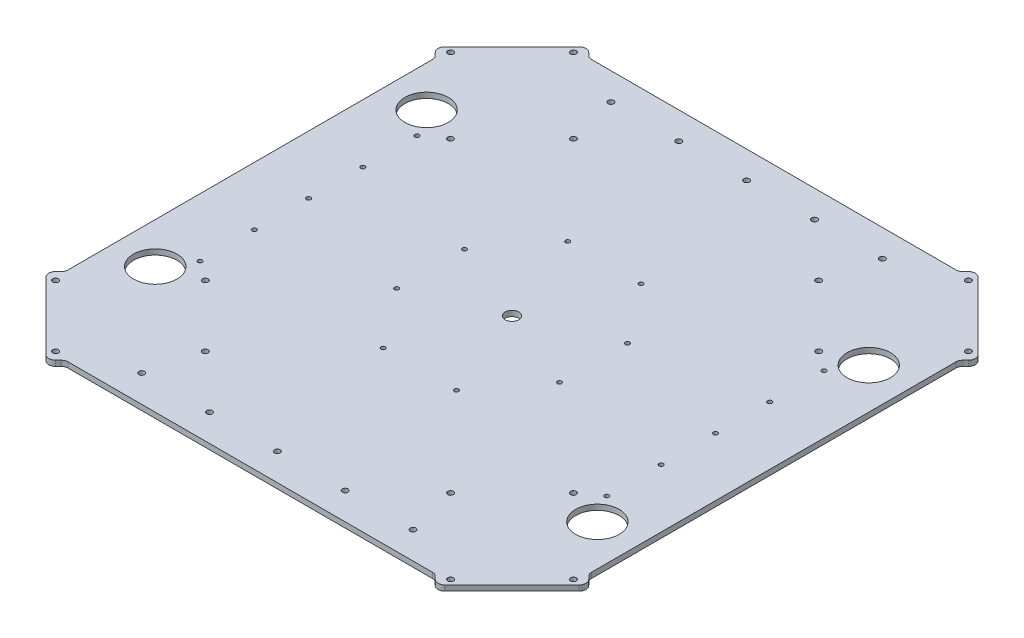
from build123d import *

# Parameters (mm, degrees)
EXTRUDE_1_DEPTH     = 4
SKETCH_2_R          = 2.1
CUT_EXTRUDE_1_DEPTH = 283.870995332
CUT_EXTRUDE_2_DEPTH = 283.870995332
SKETCH_4_R          = 5
CUT_EXTRUDE_3_DEPTH = 283.870995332
SKETCH_5_R          = 16
CUT_EXTRUDE_4_DEPTH = 283.870995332
SKETCH_6_R          = 1.6
CUT_EXTRUDE_5_DEPTH = 283.870995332
SKETCH_7_R          = 2.1
CUT_EXTRUDE_6_DEPTH = 283.870995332
SKETCH_8_R          = 1.6
CUT_EXTRUDE_7_DEPTH = 10
FILLET_1_R          = 5


with BuildPart() as part:
    # Sketch 1 → Extrude 1 (new body)
    with BuildSketch(Plane(origin=(0, 0, 0), x_dir=(1, 0, 0), z_dir=(0, 1, 0))):
        Polygon((143.431457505, 200), (-143.431457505, 200), (-200, 143.431457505), (-200, -143.431457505), (-143.431457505, -200), (143.431457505, -200), (200, -143.431457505), (200, 143.431457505), align=None)
    extrude(amount=EXTRUDE_1_DEPTH)

    # Sketch 2 → Cut-Extrude 1 (cut, through all)
    with BuildSketch(Plane(origin=(0, 4, 0), x_dir=(1, 0, 0), z_dir=(0, 1, 0))):
        with Locations(Location((-190.807611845, 145.552777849, 0), (0, 0, 270))):
            Circle(SKETCH_2_R)
        with Locations(Location((-145.552777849, 190.807611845, 0), (0, 0, 270))):
            Circle(SKETCH_2_R)
        with Locations(Location((-135.653282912, 90.398448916, 0), (0, 0, 270))):
            Circle(SKETCH_2_R)
        with Locations(Location((-90.398448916, 135.653282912, 0), (0, 0, 270))):
            Circle(SKETCH_2_R)
        with Locations(Location((145.552777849, 190.807611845, 0), (0, 0, 270))):
            Circle(SKETCH_2_R)
        with Locations(Location((190.807611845, 145.552777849, 0), (0, 0, 270))):
            Circle(SKETCH_2_R)
        with Locations(Location((90.398448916, 135.653282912, 0), (0, 0, 270))):
            Circle(SKETCH_2_R)
        with Locations(Location((135.653282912, 90.398448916, 0), (0, 0, 270))):
            Circle(SKETCH_2_R)
        with Locations(Location((190.807611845, -145.552777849, 0), (0, 0, 270))):
            Circle(SKETCH_2_R)
        with Locations(Location((145.552777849, -190.807611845, 0), (0, 0, 270))):
            Circle(SKETCH_2_R)
        with Locations(Location((135.653282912, -90.398448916, 0), (0, 0, 270))):
            Circle(SKETCH_2_R)
        with Locations(Location((90.398448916, -135.653282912, 0), (0, 0, 270))):
            Circle(SKETCH_2_R)
        with Locations(Location((-145.552777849, -190.807611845, 0), (0, 0, 270))):
            Circle(SKETCH_2_R)
        with Locations(Location((-190.807611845, -145.552777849, 0), (0, 0, 270))):
            Circle(SKETCH_2_R)
        with Locations(Location((-90.398448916, -135.653282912, 0), (0, 0, 270))):
            Circle(SKETCH_2_R)
        with Locations(Location((-135.653282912, -90.398448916, 0), (0, 0, 270))):
            Circle(SKETCH_2_R)
    extrude(amount=-CUT_EXTRUDE_1_DEPTH, mode=Mode.SUBTRACT)

    # Sketch 3 → Cut-Extrude 2 (cut, through all)
    with BuildSketch(Plane(origin=(0, 4, 0), x_dir=(1, 0, 0), z_dir=(0, 1, 0))):
        Polygon((-200, 143.431457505), (-192.928932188, 136.360389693), (-192.928932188, -136.360389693), (-200, -143.431457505), align=None)
        Polygon((143.431457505, 200), (136.360389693, 192.928932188), (-136.360389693, 192.928932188), (-143.431457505, 200), align=None)
        Polygon((200, -143.431457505), (192.928932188, -136.360389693), (192.928932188, 136.360389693), (200, 143.431457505), align=None)
        Polygon((-143.431457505, -200), (-136.360389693, -192.928932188), (136.360389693, -192.928932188), (143.431457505, -200), align=None)
    extrude(amount=-CUT_EXTRUDE_2_DEPTH, mode=Mode.SUBTRACT)

    # Sketch 4 → Cut-Extrude 3 (cut, through all)
    with BuildSketch(Plane(origin=(0, 4, 0), x_dir=(1, 0, 0), z_dir=(0, 1, 0))):
        with Locations(Location((0, 0, 0), (0, 0, 270))):
            Circle(SKETCH_4_R)
    extrude(amount=-CUT_EXTRUDE_3_DEPTH, mode=Mode.SUBTRACT)

    # Sketch 5 → Cut-Extrude 4 (cut, through all)
    with BuildSketch(Plane.XZ):
        with Locations(Location((162.928932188, 100, 0), (0, 0, 270))):
            Circle(SKETCH_5_R)
        with Locations(Location((162.928932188, -100, 0), (0, 0, 270))):
            Circle(SKETCH_5_R)
        with Locations(Location((-162.928932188, -100, 0), (0, 0, 90))):
            Circle(SKETCH_5_R)
        with Locations(Location((-162.928932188, 100, 0), (0, 0, 90))):
            Circle(SKETCH_5_R)
    extrude(amount=-CUT_EXTRUDE_4_DEPTH, mode=Mode.SUBTRACT)

    # Sketch 6 → Cut-Extrude 5 (cut, through all)
    with BuildSketch(Plane.XZ):
        with Locations(Location((-149.928932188, 80, 0), (0, 0, 270))):
            Circle(SKETCH_6_R)
        with Locations(Location((-149.928932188, 40, 0), (0, 0, 270))):
            Circle(SKETCH_6_R)
        with Locations(Location((-149.928932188, 0, 0), (0, 0, 270))):
            Circle(SKETCH_6_R)
        with Locations(Location((-149.928932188, -40, 0), (0, 0, 270))):
            Circle(SKETCH_6_R)
        with Locations(Location((-149.928932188, -80, 0), (0, 0, 270))):
            Circle(SKETCH_6_R)
        with Locations(Location((149.928932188, -80, 0), (0, 0, 90))):
            Circle(SKETCH_6_R)
        with Locations(Location((149.928932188, -40, 0), (0, 0, 90))):
            Circle(SKETCH_6_R)
        with Locations(Location((149.928932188, 0, 0), (0, 0, 90))):
            Circle(SKETCH_6_R)
        with Locations(Location((149.928932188, 40, 0), (0, 0, 90))):
            Circle(SKETCH_6_R)
        with Locations(Location((149.928932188, 80, 0), (0, 0, 90))):
            Circle(SKETCH_6_R)
    extrude(amount=-CUT_EXTRUDE_5_DEPTH, mode=Mode.SUBTRACT)

    # Sketch 7 → Cut-Extrude 6 (cut, through all)
    with BuildSketch(Plane(origin=(0, 4, 0), x_dir=(1, 0, 0), z_dir=(0, 1, 0))):
        with Locations(Location((0, 172.928932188, 0), (0, 0, 270))):
            Circle(SKETCH_7_R)
        with Locations(Location((50, 172.928932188, 0), (0, 0, 270))):
            Circle(SKETCH_7_R)
        with Locations(Location((100, 172.928932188, 0), (0, 0, 270))):
            Circle(SKETCH_7_R)
        with Locations(Location((-100, 172.928932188, 0), (0, 0, 90))):
            Circle(SKETCH_7_R)
        with Locations(Location((-50, 172.928932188, 0), (0, 0, 90))):
            Circle(SKETCH_7_R)
        with Locations(Location((-50, -172.928932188, 0), (0, 0, 270))):
            Circle(SKETCH_7_R)
        with Locations(Location((-100, -172.928932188, 0), (0, 0, 270))):
            Circle(SKETCH_7_R)
        with Locations(Location((100, -172.928932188, 0), (0, 0, 90))):
            Circle(SKETCH_7_R)
        with Locations(Location((50, -172.928932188, 0), (0, 0, 90))):
            Circle(SKETCH_7_R)
        with Locations(Location((0, -172.928932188, 0), (0, 0, 90))):
            Circle(SKETCH_7_R)
    extrude(amount=-CUT_EXTRUDE_6_DEPTH, mode=Mode.SUBTRACT)

    # Sketch 8 → Cut-Extrude 7 (cut)
    with BuildSketch(Plane(origin=(0, 4, 0), x_dir=(1, 0, 0), z_dir=(0, 1, 0))):
        with Locations(Location((60, 25, 0), (0, 0, 270))):
            Circle(SKETCH_8_R)
        with Locations(Location((27, 68, 0), (0, 0, 270))):
            Circle(SKETCH_8_R)
        with Locations(Location((27, -68, 0), (0, 0, 270))):
            Circle(SKETCH_8_R)
        with Locations(Location((60, -25, 0), (0, 0, 270))):
            Circle(SKETCH_8_R)
        with Locations(Location((-60, -25, 0), (0, 0, 270))):
            Circle(SKETCH_8_R)
        with Locations(Location((-27, -68, 0), (0, 0, 270))):
            Circle(SKETCH_8_R)
        with Locations(Location((-27, 68, 0), (0, 0, 270))):
            Circle(SKETCH_8_R)
        with Locations(Location((-60, 25, 0), (0, 0, 270))):
            Circle(SKETCH_8_R)
    extrude(amount=-CUT_EXTRUDE_7_DEPTH, mode=Mode.SUBTRACT)

    # Fillet 1
    fillet_1_edges = [part.edges().sort_by_distance(p)[0] for p in [
        (-192.928932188, 2, -136.360389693),
        (-192.928932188, 2, 136.360389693),
        (136.360389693, 2, -192.928932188),
        (-136.360389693, 2, -192.928932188),
        (192.928932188, 2, 136.360389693),
        (192.928932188, 2, -136.360389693),
        (-136.360389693, 2, 192.928932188),
        (136.360389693, 2, 192.928932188),
        (-200, 2, -143.431457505),
        (-143.431457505, 2, -200),
        (143.431457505, 2, -200),
        (200, 2, -143.431457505),
        (200, 2, 143.431457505),
        (143.431457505, 2, 200),
        (-143.431457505, 2, 200),
        (-200, 2, 143.431457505),
    ]]
    fillet(fillet_1_edges, radius=FILLET_1_R)


solid = part.part
